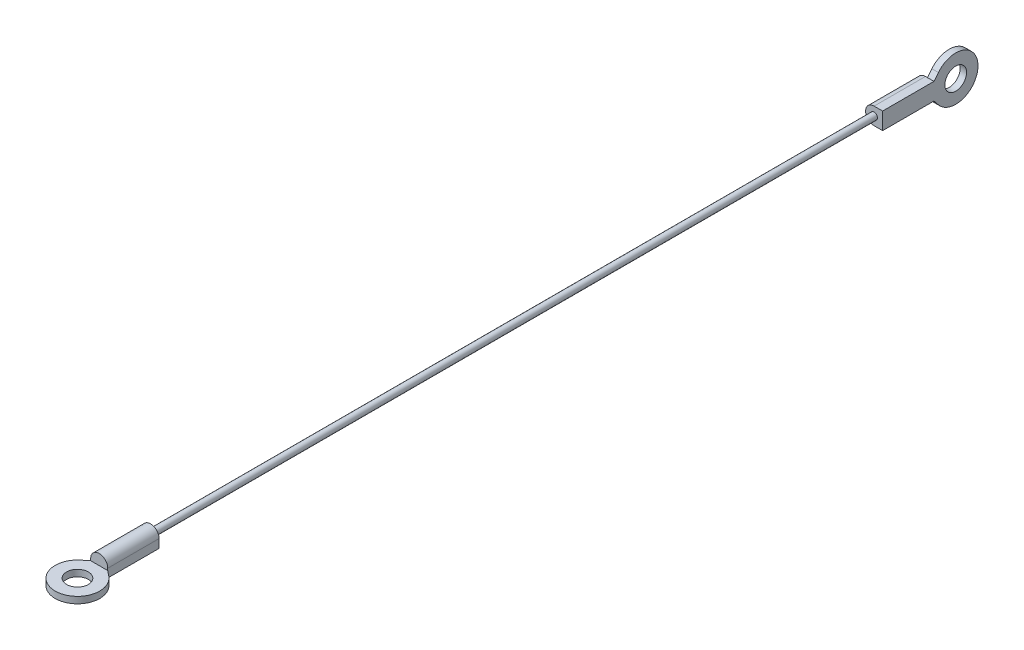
ISO-10303-21;
HEADER;
FILE_DESCRIPTION(('STEP AP214'),'2;1');
FILE_NAME('part.step','',(''),(''),'','','');
FILE_SCHEMA(('AUTOMOTIVE_DESIGN { 1 0 10303 214 1 1 1 1 }'));
ENDSEC;
DATA;
#1=APPLICATION_CONTEXT('core data for automotive mechanical design processes');
#2=APPLICATION_PROTOCOL_DEFINITION('international standard','automotive_design',2000,#1);
#3=PRODUCT_CONTEXT('',#1,'mechanical');
#4=PRODUCT('Part','Part','',(#3));
#5=PRODUCT_RELATED_PRODUCT_CATEGORY('part','',(#4));
#6=PRODUCT_DEFINITION_FORMATION('','',#4);
#7=PRODUCT_DEFINITION_CONTEXT('part definition',#1,'design');
#8=PRODUCT_DEFINITION('design','',#6,#7);
#9=PRODUCT_DEFINITION_SHAPE('','',#8);
#10=(LENGTH_UNIT() NAMED_UNIT(*) SI_UNIT(.MILLI.,.METRE.));
#11=(NAMED_UNIT(*) PLANE_ANGLE_UNIT() SI_UNIT($,.RADIAN.));
#12=(NAMED_UNIT(*) SI_UNIT($,.STERADIAN.) SOLID_ANGLE_UNIT());
#13=UNCERTAINTY_MEASURE_WITH_UNIT(LENGTH_MEASURE(1.E-05),#10,'distance_accuracy_value','');
#14=(GEOMETRIC_REPRESENTATION_CONTEXT(3) GLOBAL_UNCERTAINTY_ASSIGNED_CONTEXT((#13)) GLOBAL_UNIT_ASSIGNED_CONTEXT((#10,
#11,#12)) REPRESENTATION_CONTEXT('',''));
#15=CARTESIAN_POINT('',(0.,0.,0.));
#16=DIRECTION('',(0.,0.,1.));
#17=DIRECTION('',(1.,0.,0.));
#18=AXIS2_PLACEMENT_3D('',#15,#16,#17);
#19=CARTESIAN_POINT('',(0.,0.,-96.52));
#20=DIRECTION('',(0.,0.,-1.));
#21=DIRECTION('',(-1.,0.,0.));
#22=AXIS2_PLACEMENT_3D('',#19,#20,#21);
#23=PLANE('',#22);
#24=DIRECTION('',(1.,0.,0.));
#25=VECTOR('',#24,1.);
#26=CARTESIAN_POINT('',(0.,1.99,-96.52));
#27=LINE('',#26,#25);
#28=CARTESIAN_POINT('',(0.,1.99,-96.52));
#29=VERTEX_POINT('',#28);
#30=CARTESIAN_POINT('',(0.47,1.99,-96.52));
#31=VERTEX_POINT('',#30);
#32=EDGE_CURVE('E197',#29,#31,#27,.T.);
#33=ORIENTED_EDGE('',*,*,#32,.T.);
#34=DIRECTION('',(0.,-1.,0.));
#35=VECTOR('',#34,1.);
#36=CARTESIAN_POINT('',(0.47,-1.99,-96.52));
#37=LINE('',#36,#35);
#38=CARTESIAN_POINT('',(0.47,-1.99,-96.52));
#39=VERTEX_POINT('',#38);
#40=EDGE_CURVE('E154',#31,#39,#37,.T.);
#41=ORIENTED_EDGE('',*,*,#40,.T.);
#42=DIRECTION('',(-1.,0.,0.));
#43=VECTOR('',#42,1.);
#44=CARTESIAN_POINT('',(1.99,-1.99,-96.52));
#45=LINE('',#44,#43);
#46=CARTESIAN_POINT('',(0.,-1.99,-96.52));
#47=VERTEX_POINT('',#46);
#48=EDGE_CURVE('E202',#39,#47,#45,.T.);
#49=ORIENTED_EDGE('',*,*,#48,.T.);
#50=CARTESIAN_POINT('',(0.,0.,-96.52));
#51=DIRECTION('',(0.,0.,-1.));
#52=DIRECTION('',(-1.,0.,0.));
#53=AXIS2_PLACEMENT_3D('',#50,#51,#52);
#54=CIRCLE('',#53,1.99);
#55=EDGE_CURVE('E193',#47,#29,#54,.T.);
#56=ORIENTED_EDGE('',*,*,#55,.T.);
#57=EDGE_LOOP('',(#33,#41,#49,#56));
#58=FACE_BOUND('',#57,.T.);
#59=ADVANCED_FACE('F39',(#58),#23,.T.);
#60=CARTESIAN_POINT('',(0.,0.,96.52));
#61=DIRECTION('',(0.,0.,1.));
#62=DIRECTION('',(1.,0.,0.));
#63=AXIS2_PLACEMENT_3D('',#60,#61,#62);
#64=PLANE('',#63);
#65=DIRECTION('',(0.,-1.,0.));
#66=VECTOR('',#65,1.);
#67=CARTESIAN_POINT('',(-1.99,0.,96.52));
#68=LINE('',#67,#66);
#69=CARTESIAN_POINT('',(-1.99,0.,96.52));
#70=VERTEX_POINT('',#69);
#71=CARTESIAN_POINT('',(-1.99,-0.47,96.52));
#72=VERTEX_POINT('',#71);
#73=EDGE_CURVE('E280',#70,#72,#68,.T.);
#74=ORIENTED_EDGE('',*,*,#73,.T.);
#75=DIRECTION('',(1.,0.,0.));
#76=VECTOR('',#75,1.);
#77=CARTESIAN_POINT('',(-1.99,-0.47,96.52));
#78=LINE('',#77,#76);
#79=CARTESIAN_POINT('',(1.99,-0.47,96.52));
#80=VERTEX_POINT('',#79);
#81=EDGE_CURVE('E241',#72,#80,#78,.T.);
#82=ORIENTED_EDGE('',*,*,#81,.T.);
#83=DIRECTION('',(0.,1.,0.));
#84=VECTOR('',#83,1.);
#85=CARTESIAN_POINT('',(1.99,-1.99,96.52));
#86=LINE('',#85,#84);
#87=CARTESIAN_POINT('',(1.99,0.,96.52));
#88=VERTEX_POINT('',#87);
#89=EDGE_CURVE('E285',#80,#88,#86,.T.);
#90=ORIENTED_EDGE('',*,*,#89,.T.);
#91=CARTESIAN_POINT('',(0.,0.,96.52));
#92=DIRECTION('',(0.,0.,1.));
#93=DIRECTION('',(1.,0.,0.));
#94=AXIS2_PLACEMENT_3D('',#91,#92,#93);
#95=CIRCLE('',#94,1.99);
#96=EDGE_CURVE('E276',#88,#70,#95,.T.);
#97=ORIENTED_EDGE('',*,*,#96,.T.);
#98=EDGE_LOOP('',(#74,#82,#90,#97));
#99=FACE_BOUND('',#98,.T.);
#100=ADVANCED_FACE('F339',(#99),#64,.T.);
#101=CARTESIAN_POINT('',(0.,0.,84.52));
#102=DIRECTION('',(0.,0.,-1.));
#103=DIRECTION('',(-1.,0.,0.));
#104=AXIS2_PLACEMENT_3D('',#101,#102,#103);
#105=CYLINDRICAL_SURFACE('',#104,0.795);
#106=CARTESIAN_POINT('',(0.,0.,84.52));
#107=DIRECTION('',(0.,0.,1.));
#108=DIRECTION('',(1.,0.,0.));
#109=AXIS2_PLACEMENT_3D('',#106,#107,#108);
#110=CIRCLE('',#109,0.795);
#111=CARTESIAN_POINT('',(0.795,0.,84.52));
#112=VERTEX_POINT('',#111);
#113=EDGE_CURVE('E11',#112,#112,#110,.T.);
#114=ORIENTED_EDGE('',*,*,#113,.F.);
#115=EDGE_LOOP('',(#114));
#116=FACE_BOUND('',#115,.T.);
#117=CARTESIAN_POINT('',(0.,0.,-84.52));
#118=DIRECTION('',(0.,0.,1.));
#119=DIRECTION('',(1.,0.,0.));
#120=AXIS2_PLACEMENT_3D('',#117,#118,#119);
#121=CIRCLE('',#120,0.795);
#122=CARTESIAN_POINT('',(0.795,0.,-84.52));
#123=VERTEX_POINT('',#122);
#124=EDGE_CURVE('E43',#123,#123,#121,.T.);
#125=ORIENTED_EDGE('',*,*,#124,.T.);
#126=EDGE_LOOP('',(#125));
#127=FACE_BOUND('',#126,.T.);
#128=ADVANCED_FACE('F41',(#116,#127),#105,.T.);
#129=CARTESIAN_POINT('',(0.,0.,96.52));
#130=DIRECTION('',(0.,0.,-1.));
#131=DIRECTION('',(-1.,0.,0.));
#132=AXIS2_PLACEMENT_3D('',#129,#130,#131);
#133=CYLINDRICAL_SURFACE('',#132,1.99);
#134=CARTESIAN_POINT('',(0.,0.,84.52));
#135=DIRECTION('',(0.,0.,1.));
#136=DIRECTION('',(1.,0.,0.));
#137=AXIS2_PLACEMENT_3D('',#134,#135,#136);
#138=CIRCLE('',#137,1.99);
#139=CARTESIAN_POINT('',(1.99,0.,84.52));
#140=VERTEX_POINT('',#139);
#141=CARTESIAN_POINT('',(-1.99,0.,84.52));
#142=VERTEX_POINT('',#141);
#143=EDGE_CURVE('E270',#140,#142,#138,.T.);
#144=ORIENTED_EDGE('',*,*,#143,.T.);
#145=DIRECTION('',(0.,0.,-1.));
#146=VECTOR('',#145,1.);
#147=CARTESIAN_POINT('',(-1.99,0.,96.52));
#148=LINE('',#147,#146);
#149=EDGE_CURVE('E49',#70,#142,#148,.T.);
#150=ORIENTED_EDGE('',*,*,#149,.F.);
#151=ORIENTED_EDGE('',*,*,#96,.F.);
#152=DIRECTION('',(0.,0.,-1.));
#153=VECTOR('',#152,1.);
#154=CARTESIAN_POINT('',(1.99,0.,96.52));
#155=LINE('',#154,#153);
#156=EDGE_CURVE('E289',#88,#140,#155,.T.);
#157=ORIENTED_EDGE('',*,*,#156,.T.);
#158=EDGE_LOOP('',(#144,#150,#151,#157));
#159=FACE_BOUND('',#158,.T.);
#160=ADVANCED_FACE('F323',(#159),#133,.T.);
#161=CARTESIAN_POINT('',(-1.99,0.,96.52));
#162=DIRECTION('',(1.,0.,0.));
#163=DIRECTION('',(0.,1.,0.));
#164=AXIS2_PLACEMENT_3D('',#161,#162,#163);
#165=PLANE('',#164);
#166=DIRECTION('',(0.,-1.,0.));
#167=VECTOR('',#166,1.);
#168=CARTESIAN_POINT('',(-1.99,0.,84.52));
#169=LINE('',#168,#167);
#170=CARTESIAN_POINT('',(-1.99,-1.99,84.52));
#171=VERTEX_POINT('',#170);
#172=EDGE_CURVE('E293',#142,#171,#169,.T.);
#173=ORIENTED_EDGE('',*,*,#172,.T.);
#174=DIRECTION('',(0.,0.,-1.));
#175=VECTOR('',#174,1.);
#176=CARTESIAN_POINT('',(-1.99,-1.99,96.52));
#177=LINE('',#176,#175);
#178=CARTESIAN_POINT('',(-1.99,-1.99,96.52));
#179=VERTEX_POINT('',#178);
#180=EDGE_CURVE('E309',#179,#171,#177,.T.);
#181=ORIENTED_EDGE('',*,*,#180,.F.);
#182=DIRECTION('',(0.,-1.,0.));
#183=VECTOR('',#182,1.);
#184=CARTESIAN_POINT('',(-1.99,-0.47,96.52));
#185=LINE('',#184,#183);
#186=EDGE_CURVE('E267',#72,#179,#185,.T.);
#187=ORIENTED_EDGE('',*,*,#186,.F.);
#188=ORIENTED_EDGE('',*,*,#73,.F.);
#189=ORIENTED_EDGE('',*,*,#149,.T.);
#190=EDGE_LOOP('',(#173,#181,#187,#188,#189));
#191=FACE_BOUND('',#190,.T.);
#192=ADVANCED_FACE('F317',(#191),#165,.F.);
#193=CARTESIAN_POINT('',(0.,-1.99,96.52));
#194=DIRECTION('',(0.,1.,0.));
#195=DIRECTION('',(0.,0.,1.));
#196=AXIS2_PLACEMENT_3D('',#193,#194,#195);
#197=PLANE('',#196);
#198=DIRECTION('',(1.,0.,0.));
#199=VECTOR('',#198,1.);
#200=CARTESIAN_POINT('',(0.,-1.99,84.52));
#201=LINE('',#200,#199);
#202=CARTESIAN_POINT('',(1.99,-1.99,84.52));
#203=VERTEX_POINT('',#202);
#204=EDGE_CURVE('E297',#171,#203,#201,.T.);
#205=ORIENTED_EDGE('',*,*,#204,.T.);
#206=DIRECTION('',(0.,0.,-1.));
#207=VECTOR('',#206,1.);
#208=CARTESIAN_POINT('',(1.99,-1.99,96.52));
#209=LINE('',#208,#207);
#210=CARTESIAN_POINT('',(1.99,-1.99,96.52));
#211=VERTEX_POINT('',#210);
#212=EDGE_CURVE('E305',#211,#203,#209,.T.);
#213=ORIENTED_EDGE('',*,*,#212,.F.);
#214=DIRECTION('',(0.778962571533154,0.,0.627070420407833));
#215=VECTOR('',#214,1.);
#216=CARTESIAN_POINT('',(1.99,-1.99,96.52));
#217=LINE('',#216,#215);
#218=CARTESIAN_POINT('',(3.2639015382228,-1.99,97.5454998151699));
#219=VERTEX_POINT('',#218);
#220=EDGE_CURVE('E236',#211,#219,#217,.T.);
#221=ORIENTED_EDGE('',*,*,#220,.T.);
#222=CARTESIAN_POINT('',(0.,-1.99,101.6));
#223=DIRECTION('',(0.,-1.,0.));
#224=DIRECTION('',(0.,0.,-1.));
#225=AXIS2_PLACEMENT_3D('',#222,#223,#224);
#226=CIRCLE('',#225,5.20500000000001);
#227=CARTESIAN_POINT('',(-3.2639015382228,-1.99,97.5454998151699));
#228=VERTEX_POINT('',#227);
#229=EDGE_CURVE('E260',#219,#228,#226,.T.);
#230=ORIENTED_EDGE('',*,*,#229,.T.);
#231=DIRECTION('',(0.778962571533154,0.,-0.627070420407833));
#232=VECTOR('',#231,1.);
#233=CARTESIAN_POINT('',(-3.2639015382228,-1.99,97.5454998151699));
#234=LINE('',#233,#232);
#235=EDGE_CURVE('E245',#228,#179,#234,.T.);
#236=ORIENTED_EDGE('',*,*,#235,.T.);
#237=ORIENTED_EDGE('',*,*,#180,.T.);
#238=EDGE_LOOP('',(#205,#213,#221,#230,#236,#237));
#239=FACE_BOUND('',#238,.T.);
#240=CARTESIAN_POINT('',(0.,-1.99,101.6));
#241=DIRECTION('',(0.,-1.,0.));
#242=DIRECTION('',(0.,0.,-1.));
#243=AXIS2_PLACEMENT_3D('',#240,#241,#242);
#244=CIRCLE('',#243,2.53999999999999);
#245=CARTESIAN_POINT('',(0.,-1.99,99.06));
#246=VERTEX_POINT('',#245);
#247=EDGE_CURVE('E237',#246,#246,#244,.T.);
#248=ORIENTED_EDGE('',*,*,#247,.F.);
#249=EDGE_LOOP('',(#248));
#250=FACE_BOUND('',#249,.T.);
#251=ADVANCED_FACE('F330',(#239,#250),#197,.F.);
#252=CARTESIAN_POINT('',(1.99,-1.99,96.52));
#253=DIRECTION('',(-1.,0.,0.));
#254=DIRECTION('',(0.,-1.,0.));
#255=AXIS2_PLACEMENT_3D('',#252,#253,#254);
#256=PLANE('',#255);
#257=DIRECTION('',(0.,1.,0.));
#258=VECTOR('',#257,1.);
#259=CARTESIAN_POINT('',(1.99,-1.99,84.52));
#260=LINE('',#259,#258);
#261=EDGE_CURVE('E281',#203,#140,#260,.T.);
#262=ORIENTED_EDGE('',*,*,#261,.T.);
#263=ORIENTED_EDGE('',*,*,#156,.F.);
#264=ORIENTED_EDGE('',*,*,#89,.F.);
#265=EDGE_CURVE('E286',#211,#80,#86,.T.);
#266=ORIENTED_EDGE('',*,*,#265,.F.);
#267=ORIENTED_EDGE('',*,*,#212,.T.);
#268=EDGE_LOOP('',(#262,#263,#264,#266,#267));
#269=FACE_BOUND('',#268,.T.);
#270=ADVANCED_FACE('F334',(#269),#256,.F.);
#271=CARTESIAN_POINT('',(0.,0.,84.52));
#272=DIRECTION('',(0.,0.,1.));
#273=DIRECTION('',(1.,0.,0.));
#274=AXIS2_PLACEMENT_3D('',#271,#272,#273);
#275=PLANE('',#274);
#276=ORIENTED_EDGE('',*,*,#113,.T.);
#277=EDGE_LOOP('',(#276));
#278=FACE_BOUND('',#277,.T.);
#279=ORIENTED_EDGE('',*,*,#143,.F.);
#280=ORIENTED_EDGE('',*,*,#261,.F.);
#281=ORIENTED_EDGE('',*,*,#204,.F.);
#282=ORIENTED_EDGE('',*,*,#172,.F.);
#283=EDGE_LOOP('',(#279,#280,#281,#282));
#284=FACE_BOUND('',#283,.T.);
#285=ADVANCED_FACE('F327',(#278,#284),#275,.F.);
#286=CARTESIAN_POINT('',(-3.2639015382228,-0.47,97.5454998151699));
#287=DIRECTION('',(-0.627070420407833,0.,-0.778962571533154));
#288=DIRECTION('',(-0.778962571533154,0.,0.627070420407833));
#289=AXIS2_PLACEMENT_3D('',#286,#287,#288);
#290=PLANE('',#289);
#291=ORIENTED_EDGE('',*,*,#235,.F.);
#292=DIRECTION('',(0.,-1.,0.));
#293=VECTOR('',#292,1.);
#294=CARTESIAN_POINT('',(-3.2639015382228,-0.47,97.5454998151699));
#295=LINE('',#294,#293);
#296=CARTESIAN_POINT('',(-3.2639015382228,-0.47,97.5454998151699));
#297=VERTEX_POINT('',#296);
#298=EDGE_CURVE('E271',#297,#228,#295,.T.);
#299=ORIENTED_EDGE('',*,*,#298,.F.);
#300=DIRECTION('',(0.778962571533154,0.,-0.627070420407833));
#301=VECTOR('',#300,1.);
#302=CARTESIAN_POINT('',(-3.2639015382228,-0.47,97.5454998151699));
#303=LINE('',#302,#301);
#304=EDGE_CURVE('E252',#297,#72,#303,.T.);
#305=ORIENTED_EDGE('',*,*,#304,.T.);
#306=ORIENTED_EDGE('',*,*,#186,.T.);
#307=EDGE_LOOP('',(#291,#299,#305,#306));
#308=FACE_BOUND('',#307,.T.);
#309=ADVANCED_FACE('F344',(#308),#290,.T.);
#310=CARTESIAN_POINT('',(0.,-0.47,101.6));
#311=DIRECTION('',(0.,-1.,0.));
#312=DIRECTION('',(0.,0.,-1.));
#313=AXIS2_PLACEMENT_3D('',#310,#311,#312);
#314=CYLINDRICAL_SURFACE('',#313,5.20500000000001);
#315=ORIENTED_EDGE('',*,*,#229,.F.);
#316=DIRECTION('',(0.,-1.,0.));
#317=VECTOR('',#316,1.);
#318=CARTESIAN_POINT('',(3.2639015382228,-0.47,97.5454998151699));
#319=LINE('',#318,#317);
#320=CARTESIAN_POINT('',(3.2639015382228,-0.47,97.5454998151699));
#321=VERTEX_POINT('',#320);
#322=EDGE_CURVE('E256',#321,#219,#319,.T.);
#323=ORIENTED_EDGE('',*,*,#322,.F.);
#324=CARTESIAN_POINT('',(0.,-0.47,101.6));
#325=DIRECTION('',(0.,-1.,0.));
#326=DIRECTION('',(0.,0.,-1.));
#327=AXIS2_PLACEMENT_3D('',#324,#325,#326);
#328=CIRCLE('',#327,5.20500000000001);
#329=EDGE_CURVE('E248',#321,#297,#328,.T.);
#330=ORIENTED_EDGE('',*,*,#329,.T.);
#331=ORIENTED_EDGE('',*,*,#298,.T.);
#332=EDGE_LOOP('',(#315,#323,#330,#331));
#333=FACE_BOUND('',#332,.T.);
#334=ADVANCED_FACE('F347',(#333),#314,.T.);
#335=CARTESIAN_POINT('',(1.99,-0.47,96.52));
#336=DIRECTION('',(0.627070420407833,0.,-0.778962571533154));
#337=DIRECTION('',(-0.778962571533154,0.,-0.627070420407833));
#338=AXIS2_PLACEMENT_3D('',#335,#336,#337);
#339=PLANE('',#338);
#340=ORIENTED_EDGE('',*,*,#220,.F.);
#341=ORIENTED_EDGE('',*,*,#265,.T.);
#342=DIRECTION('',(0.778962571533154,0.,0.627070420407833));
#343=VECTOR('',#342,1.);
#344=CARTESIAN_POINT('',(1.99,-0.47,96.52));
#345=LINE('',#344,#343);
#346=EDGE_CURVE('E64',#80,#321,#345,.T.);
#347=ORIENTED_EDGE('',*,*,#346,.T.);
#348=ORIENTED_EDGE('',*,*,#322,.T.);
#349=EDGE_LOOP('',(#340,#341,#347,#348));
#350=FACE_BOUND('',#349,.T.);
#351=ADVANCED_FACE('F337',(#350),#339,.T.);
#352=CARTESIAN_POINT('',(0.,-0.47,101.6));
#353=DIRECTION('',(0.,-1.,0.));
#354=DIRECTION('',(0.,0.,-1.));
#355=AXIS2_PLACEMENT_3D('',#352,#353,#354);
#356=PLANE('',#355);
#357=CARTESIAN_POINT('',(0.,-0.47,101.6));
#358=DIRECTION('',(0.,-1.,0.));
#359=DIRECTION('',(0.,0.,-1.));
#360=AXIS2_PLACEMENT_3D('',#357,#358,#359);
#361=CIRCLE('',#360,2.53999999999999);
#362=CARTESIAN_POINT('',(0.,-0.47,99.06));
#363=VERTEX_POINT('',#362);
#364=EDGE_CURVE('E232',#363,#363,#361,.T.);
#365=ORIENTED_EDGE('',*,*,#364,.T.);
#366=EDGE_LOOP('',(#365));
#367=FACE_BOUND('',#366,.T.);
#368=ORIENTED_EDGE('',*,*,#81,.F.);
#369=ORIENTED_EDGE('',*,*,#304,.F.);
#370=ORIENTED_EDGE('',*,*,#329,.F.);
#371=ORIENTED_EDGE('',*,*,#346,.F.);
#372=EDGE_LOOP('',(#368,#369,#370,#371));
#373=FACE_BOUND('',#372,.T.);
#374=ADVANCED_FACE('F341',(#367,#373),#356,.F.);
#375=CARTESIAN_POINT('',(0.,-0.47,101.6));
#376=DIRECTION('',(0.,-1.,0.));
#377=DIRECTION('',(0.,0.,-1.));
#378=AXIS2_PLACEMENT_3D('',#375,#376,#377);
#379=CYLINDRICAL_SURFACE('',#378,2.53999999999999);
#380=ORIENTED_EDGE('',*,*,#364,.F.);
#381=EDGE_LOOP('',(#380));
#382=FACE_BOUND('',#381,.T.);
#383=ORIENTED_EDGE('',*,*,#247,.T.);
#384=EDGE_LOOP('',(#383));
#385=FACE_BOUND('',#384,.T.);
#386=ADVANCED_FACE('F385',(#382,#385),#379,.F.);
#387=CARTESIAN_POINT('',(0.,0.,-96.52));
#388=DIRECTION('',(0.,0.,1.));
#389=DIRECTION('',(1.,0.,0.));
#390=AXIS2_PLACEMENT_3D('',#387,#388,#389);
#391=CYLINDRICAL_SURFACE('',#390,1.99);
#392=CARTESIAN_POINT('',(0.,0.,-84.52));
#393=DIRECTION('',(0.,0.,-1.));
#394=DIRECTION('',(-1.,0.,0.));
#395=AXIS2_PLACEMENT_3D('',#392,#393,#394);
#396=CIRCLE('',#395,1.99);
#397=CARTESIAN_POINT('',(0.,-1.99,-84.52));
#398=VERTEX_POINT('',#397);
#399=CARTESIAN_POINT('',(0.,1.99,-84.52));
#400=VERTEX_POINT('',#399);
#401=EDGE_CURVE('E190',#398,#400,#396,.T.);
#402=ORIENTED_EDGE('',*,*,#401,.T.);
#403=DIRECTION('',(0.,0.,1.));
#404=VECTOR('',#403,1.);
#405=CARTESIAN_POINT('',(0.,1.99,-96.52));
#406=LINE('',#405,#404);
#407=EDGE_CURVE('E228',#29,#400,#406,.T.);
#408=ORIENTED_EDGE('',*,*,#407,.F.);
#409=ORIENTED_EDGE('',*,*,#55,.F.);
#410=DIRECTION('',(0.,0.,1.));
#411=VECTOR('',#410,1.);
#412=CARTESIAN_POINT('',(0.,-1.99,-96.52));
#413=LINE('',#412,#411);
#414=EDGE_CURVE('E205',#47,#398,#413,.T.);
#415=ORIENTED_EDGE('',*,*,#414,.T.);
#416=EDGE_LOOP('',(#402,#408,#409,#415));
#417=FACE_BOUND('',#416,.T.);
#418=ADVANCED_FACE('F381',(#417),#391,.T.);
#419=CARTESIAN_POINT('',(0.,1.99,-96.52));
#420=DIRECTION('',(0.,-1.,0.));
#421=DIRECTION('',(0.,0.,-1.));
#422=AXIS2_PLACEMENT_3D('',#419,#420,#421);
#423=PLANE('',#422);
#424=DIRECTION('',(1.,0.,0.));
#425=VECTOR('',#424,1.);
#426=CARTESIAN_POINT('',(0.,1.99,-84.52));
#427=LINE('',#426,#425);
#428=CARTESIAN_POINT('',(1.99,1.99,-84.52));
#429=VERTEX_POINT('',#428);
#430=EDGE_CURVE('E209',#400,#429,#427,.T.);
#431=ORIENTED_EDGE('',*,*,#430,.T.);
#432=DIRECTION('',(0.,0.,1.));
#433=VECTOR('',#432,1.);
#434=CARTESIAN_POINT('',(1.99,1.99,-96.52));
#435=LINE('',#434,#433);
#436=CARTESIAN_POINT('',(1.99,1.99,-96.52));
#437=VERTEX_POINT('',#436);
#438=EDGE_CURVE('E224',#437,#429,#435,.T.);
#439=ORIENTED_EDGE('',*,*,#438,.F.);
#440=DIRECTION('',(1.,0.,0.));
#441=VECTOR('',#440,1.);
#442=CARTESIAN_POINT('',(0.47,1.99,-96.52));
#443=LINE('',#442,#441);
#444=EDGE_CURVE('E187',#31,#437,#443,.T.);
#445=ORIENTED_EDGE('',*,*,#444,.F.);
#446=ORIENTED_EDGE('',*,*,#32,.F.);
#447=ORIENTED_EDGE('',*,*,#407,.T.);
#448=EDGE_LOOP('',(#431,#439,#445,#446,#447));
#449=FACE_BOUND('',#448,.T.);
#450=ADVANCED_FACE('F377',(#449),#423,.F.);
#451=CARTESIAN_POINT('',(1.99,0.,-96.52));
#452=DIRECTION('',(-1.,0.,0.));
#453=DIRECTION('',(0.,-1.,0.));
#454=AXIS2_PLACEMENT_3D('',#451,#452,#453);
#455=PLANE('',#454);
#456=DIRECTION('',(0.,-1.,0.));
#457=VECTOR('',#456,1.);
#458=CARTESIAN_POINT('',(1.99,0.,-84.52));
#459=LINE('',#458,#457);
#460=CARTESIAN_POINT('',(1.99,-1.99,-84.52));
#461=VERTEX_POINT('',#460);
#462=EDGE_CURVE('E213',#429,#461,#459,.T.);
#463=ORIENTED_EDGE('',*,*,#462,.T.);
#464=DIRECTION('',(0.,0.,1.));
#465=VECTOR('',#464,1.);
#466=CARTESIAN_POINT('',(1.99,-1.99,-96.52));
#467=LINE('',#466,#465);
#468=CARTESIAN_POINT('',(1.99,-1.99,-96.52));
#469=VERTEX_POINT('',#468);
#470=EDGE_CURVE('E221',#469,#461,#467,.T.);
#471=ORIENTED_EDGE('',*,*,#470,.F.);
#472=DIRECTION('',(0.,-0.778962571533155,-0.627070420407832));
#473=VECTOR('',#472,1.);
#474=CARTESIAN_POINT('',(1.99,-3.2639015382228,-97.5454998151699));
#475=LINE('',#474,#473);
#476=CARTESIAN_POINT('',(1.99,-3.2639015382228,-97.5454998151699));
#477=VERTEX_POINT('',#476);
#478=EDGE_CURVE('E181',#469,#477,#475,.T.);
#479=ORIENTED_EDGE('',*,*,#478,.T.);
#480=CARTESIAN_POINT('',(1.99,0.,-101.6));
#481=DIRECTION('',(1.,0.,0.));
#482=DIRECTION('',(0.,0.,1.));
#483=AXIS2_PLACEMENT_3D('',#480,#481,#482);
#484=CIRCLE('',#483,5.20500000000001);
#485=CARTESIAN_POINT('',(1.99,3.2639015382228,-97.5454998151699));
#486=VERTEX_POINT('',#485);
#487=EDGE_CURVE('E149',#477,#486,#484,.T.);
#488=ORIENTED_EDGE('',*,*,#487,.T.);
#489=DIRECTION('',(0.,-0.778962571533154,0.627070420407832));
#490=VECTOR('',#489,1.);
#491=CARTESIAN_POINT('',(1.99,1.99,-96.52));
#492=LINE('',#491,#490);
#493=EDGE_CURVE('E166',#486,#437,#492,.T.);
#494=ORIENTED_EDGE('',*,*,#493,.T.);
#495=ORIENTED_EDGE('',*,*,#438,.T.);
#496=EDGE_LOOP('',(#463,#471,#479,#488,#494,#495));
#497=FACE_BOUND('',#496,.T.);
#498=CARTESIAN_POINT('',(1.99,0.,-101.6));
#499=DIRECTION('',(1.,0.,0.));
#500=DIRECTION('',(0.,0.,-1.));
#501=AXIS2_PLACEMENT_3D('',#498,#499,#500);
#502=CIRCLE('',#501,2.54);
#503=CARTESIAN_POINT('',(1.99,0.,-104.14));
#504=VERTEX_POINT('',#503);
#505=EDGE_CURVE('E174',#504,#504,#502,.T.);
#506=ORIENTED_EDGE('',*,*,#505,.F.);
#507=EDGE_LOOP('',(#506));
#508=FACE_BOUND('',#507,.T.);
#509=ADVANCED_FACE('F373',(#497,#508),#455,.F.);
#510=CARTESIAN_POINT('',(1.99,-1.99,-96.52));
#511=DIRECTION('',(0.,1.,0.));
#512=DIRECTION('',(0.,0.,1.));
#513=AXIS2_PLACEMENT_3D('',#510,#511,#512);
#514=PLANE('',#513);
#515=DIRECTION('',(-1.,0.,0.));
#516=VECTOR('',#515,1.);
#517=CARTESIAN_POINT('',(1.99,-1.99,-84.52));
#518=LINE('',#517,#516);
#519=EDGE_CURVE('E198',#461,#398,#518,.T.);
#520=ORIENTED_EDGE('',*,*,#519,.T.);
#521=ORIENTED_EDGE('',*,*,#414,.F.);
#522=ORIENTED_EDGE('',*,*,#48,.F.);
#523=EDGE_CURVE('E163',#469,#39,#45,.T.);
#524=ORIENTED_EDGE('',*,*,#523,.F.);
#525=ORIENTED_EDGE('',*,*,#470,.T.);
#526=EDGE_LOOP('',(#520,#521,#522,#524,#525));
#527=FACE_BOUND('',#526,.T.);
#528=ADVANCED_FACE('F369',(#527),#514,.F.);
#529=CARTESIAN_POINT('',(0.,0.,-84.52));
#530=DIRECTION('',(0.,0.,-1.));
#531=DIRECTION('',(-1.,0.,0.));
#532=AXIS2_PLACEMENT_3D('',#529,#530,#531);
#533=PLANE('',#532);
#534=ORIENTED_EDGE('',*,*,#124,.F.);
#535=EDGE_LOOP('',(#534));
#536=FACE_BOUND('',#535,.T.);
#537=ORIENTED_EDGE('',*,*,#401,.F.);
#538=ORIENTED_EDGE('',*,*,#519,.F.);
#539=ORIENTED_EDGE('',*,*,#462,.F.);
#540=ORIENTED_EDGE('',*,*,#430,.F.);
#541=EDGE_LOOP('',(#537,#538,#539,#540));
#542=FACE_BOUND('',#541,.T.);
#543=ADVANCED_FACE('F366',(#536,#542),#533,.F.);
#544=CARTESIAN_POINT('',(0.47,-3.2639015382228,-97.5454998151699));
#545=DIRECTION('',(0.,-0.627070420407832,0.778962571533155));
#546=DIRECTION('',(0.,-0.778962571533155,-0.627070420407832));
#547=AXIS2_PLACEMENT_3D('',#544,#545,#546);
#548=PLANE('',#547);
#549=ORIENTED_EDGE('',*,*,#478,.F.);
#550=ORIENTED_EDGE('',*,*,#523,.T.);
#551=DIRECTION('',(0.,-0.778962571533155,-0.627070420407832));
#552=VECTOR('',#551,1.);
#553=CARTESIAN_POINT('',(0.47,-3.2639015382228,-97.5454998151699));
#554=LINE('',#553,#552);
#555=CARTESIAN_POINT('',(0.47,-3.2639015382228,-97.5454998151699));
#556=VERTEX_POINT('',#555);
#557=EDGE_CURVE('E56',#39,#556,#554,.T.);
#558=ORIENTED_EDGE('',*,*,#557,.T.);
#559=DIRECTION('',(1.,0.,0.));
#560=VECTOR('',#559,1.);
#561=CARTESIAN_POINT('',(0.47,-3.2639015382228,-97.5454998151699));
#562=LINE('',#561,#560);
#563=EDGE_CURVE('E145',#556,#477,#562,.T.);
#564=ORIENTED_EDGE('',*,*,#563,.T.);
#565=EDGE_LOOP('',(#549,#550,#558,#564));
#566=FACE_BOUND('',#565,.T.);
#567=ADVANCED_FACE('F161',(#566),#548,.T.);
#568=CARTESIAN_POINT('',(0.47,1.99,-96.52));
#569=DIRECTION('',(0.,0.627070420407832,0.778962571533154));
#570=DIRECTION('',(0.,-0.778962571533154,0.627070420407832));
#571=AXIS2_PLACEMENT_3D('',#568,#569,#570);
#572=PLANE('',#571);
#573=ORIENTED_EDGE('',*,*,#493,.F.);
#574=DIRECTION('',(1.,0.,0.));
#575=VECTOR('',#574,1.);
#576=CARTESIAN_POINT('',(0.47,3.2639015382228,-97.5454998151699));
#577=LINE('',#576,#575);
#578=CARTESIAN_POINT('',(0.47,3.2639015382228,-97.5454998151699));
#579=VERTEX_POINT('',#578);
#580=EDGE_CURVE('E153',#579,#486,#577,.T.);
#581=ORIENTED_EDGE('',*,*,#580,.F.);
#582=DIRECTION('',(0.,-0.778962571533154,0.627070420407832));
#583=VECTOR('',#582,1.);
#584=CARTESIAN_POINT('',(0.47,1.99,-96.52));
#585=LINE('',#584,#583);
#586=EDGE_CURVE('E158',#579,#31,#585,.T.);
#587=ORIENTED_EDGE('',*,*,#586,.T.);
#588=ORIENTED_EDGE('',*,*,#444,.T.);
#589=EDGE_LOOP('',(#573,#581,#587,#588));
#590=FACE_BOUND('',#589,.T.);
#591=ADVANCED_FACE('F430',(#590),#572,.T.);
#592=CARTESIAN_POINT('',(0.47,0.,-101.6));
#593=DIRECTION('',(1.,0.,0.));
#594=DIRECTION('',(0.,0.,-1.));
#595=AXIS2_PLACEMENT_3D('',#592,#593,#594);
#596=CYLINDRICAL_SURFACE('',#595,5.20500000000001);
#597=ORIENTED_EDGE('',*,*,#487,.F.);
#598=ORIENTED_EDGE('',*,*,#563,.F.);
#599=CARTESIAN_POINT('',(0.47,0.,-101.6));
#600=DIRECTION('',(1.,0.,0.));
#601=DIRECTION('',(0.,0.,1.));
#602=AXIS2_PLACEMENT_3D('',#599,#600,#601);
#603=CIRCLE('',#602,5.20500000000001);
#604=EDGE_CURVE('E147',#556,#579,#603,.T.);
#605=ORIENTED_EDGE('',*,*,#604,.T.);
#606=ORIENTED_EDGE('',*,*,#580,.T.);
#607=EDGE_LOOP('',(#597,#598,#605,#606));
#608=FACE_BOUND('',#607,.T.);
#609=ADVANCED_FACE('F146',(#608),#596,.T.);
#610=CARTESIAN_POINT('',(0.47,0.,-101.6));
#611=DIRECTION('',(-1.,0.,0.));
#612=DIRECTION('',(0.,0.,1.));
#613=AXIS2_PLACEMENT_3D('',#610,#611,#612);
#614=PLANE('',#613);
#615=CARTESIAN_POINT('',(0.47,0.,-101.6));
#616=DIRECTION('',(1.,0.,0.));
#617=DIRECTION('',(0.,0.,-1.));
#618=AXIS2_PLACEMENT_3D('',#615,#616,#617);
#619=CIRCLE('',#618,2.54);
#620=CARTESIAN_POINT('',(0.47,0.,-104.14));
#621=VERTEX_POINT('',#620);
#622=EDGE_CURVE('E184',#621,#621,#619,.T.);
#623=ORIENTED_EDGE('',*,*,#622,.T.);
#624=EDGE_LOOP('',(#623));
#625=FACE_BOUND('',#624,.T.);
#626=ORIENTED_EDGE('',*,*,#557,.F.);
#627=ORIENTED_EDGE('',*,*,#40,.F.);
#628=ORIENTED_EDGE('',*,*,#586,.F.);
#629=ORIENTED_EDGE('',*,*,#604,.F.);
#630=EDGE_LOOP('',(#626,#627,#628,#629));
#631=FACE_BOUND('',#630,.T.);
#632=ADVANCED_FACE('F157',(#625,#631),#614,.T.);
#633=CARTESIAN_POINT('',(0.47,0.,-101.6));
#634=DIRECTION('',(1.,0.,0.));
#635=DIRECTION('',(0.,0.,-1.));
#636=AXIS2_PLACEMENT_3D('',#633,#634,#635);
#637=CYLINDRICAL_SURFACE('',#636,2.54);
#638=ORIENTED_EDGE('',*,*,#622,.F.);
#639=EDGE_LOOP('',(#638));
#640=FACE_BOUND('',#639,.T.);
#641=ORIENTED_EDGE('',*,*,#505,.T.);
#642=EDGE_LOOP('',(#641));
#643=FACE_BOUND('',#642,.T.);
#644=ADVANCED_FACE('F436',(#640,#643),#637,.F.);
#645=CLOSED_SHELL('',(#59,#100,#128,#160,#192,#251,#270,#285,#309,#334,#351,#374,#386,#418,#450,
#509,#528,#543,#567,#591,#609,#632,#644));
#646=MANIFOLD_SOLID_BREP('B2',#645);
#647=ADVANCED_BREP_SHAPE_REPRESENTATION('',(#18,#646),#14);
#648=SHAPE_DEFINITION_REPRESENTATION(#9,#647);
ENDSEC;
END-ISO-10303-21;
